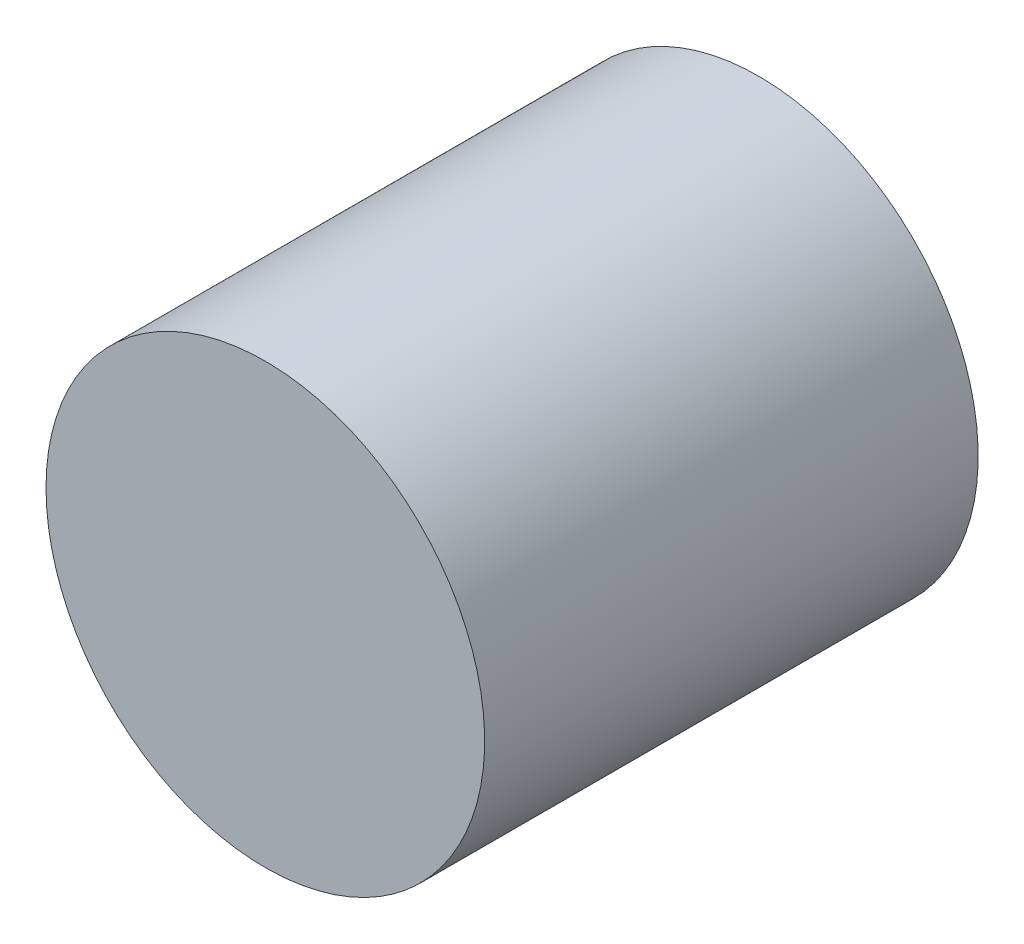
from build123d import *


with BuildPart() as part:
    # Sketch1 → Revolve1 (revolve)
    with BuildSketch(Plane(origin=(0, 0, 0), x_dir=(0, 0, -1), z_dir=(1, 0, 0)), mode=Mode.PRIVATE) as revolve1_sk:
        Polygon((0, -2.5), (0, -4), (-9, -4), (-9, 0), (-6, 0), (-6, -2.5), align=None)
    revolve(revolve1_sk.sketch.rotate(Axis((0, 0, 0), (0, 0, 1)), 270), axis=Axis((0, 0, 0), (0, 0, 1)))


solid = part.part
